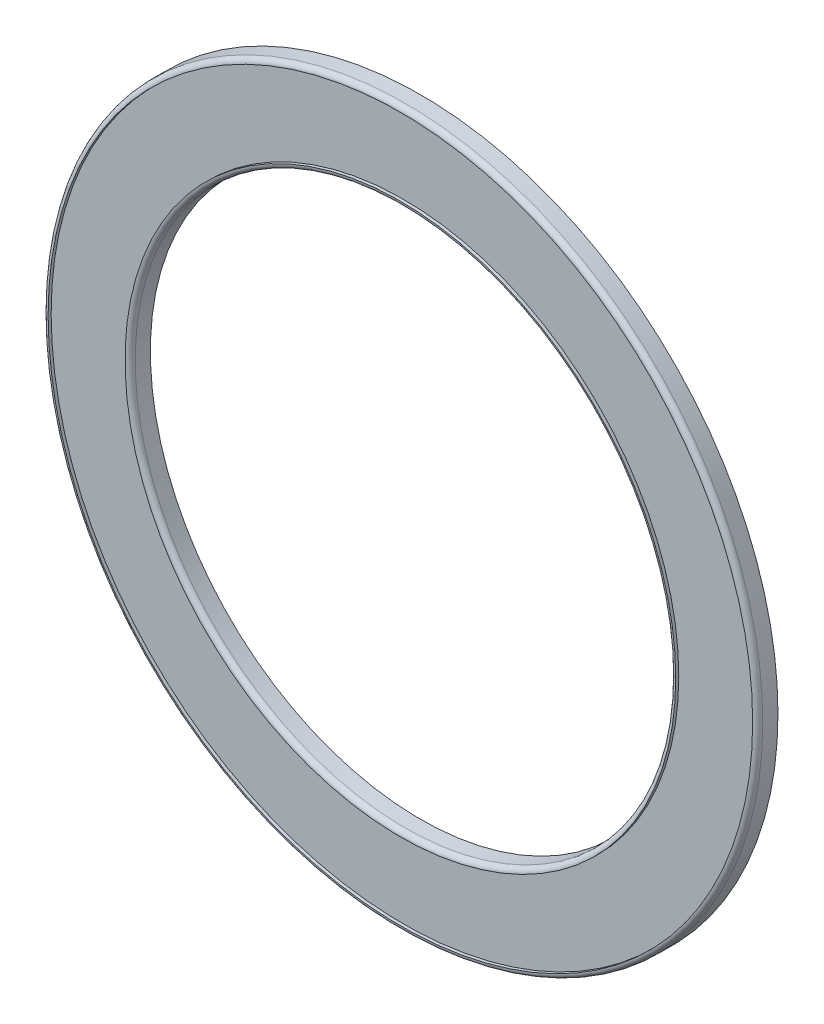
ISO-10303-21;
HEADER;
FILE_DESCRIPTION(('STEP AP214'),'2;1');
FILE_NAME('part.step','',(''),(''),'','','');
FILE_SCHEMA(('AUTOMOTIVE_DESIGN { 1 0 10303 214 1 1 1 1 }'));
ENDSEC;
DATA;
#1=APPLICATION_CONTEXT('core data for automotive mechanical design processes');
#2=APPLICATION_PROTOCOL_DEFINITION('international standard','automotive_design',2000,#1);
#3=PRODUCT_CONTEXT('',#1,'mechanical');
#4=PRODUCT('Part','Part','',(#3));
#5=PRODUCT_RELATED_PRODUCT_CATEGORY('part','',(#4));
#6=PRODUCT_DEFINITION_FORMATION('','',#4);
#7=PRODUCT_DEFINITION_CONTEXT('part definition',#1,'design');
#8=PRODUCT_DEFINITION('design','',#6,#7);
#9=PRODUCT_DEFINITION_SHAPE('','',#8);
#10=(LENGTH_UNIT() NAMED_UNIT(*) SI_UNIT(.MILLI.,.METRE.));
#11=(NAMED_UNIT(*) PLANE_ANGLE_UNIT() SI_UNIT($,.RADIAN.));
#12=(NAMED_UNIT(*) SI_UNIT($,.STERADIAN.) SOLID_ANGLE_UNIT());
#13=UNCERTAINTY_MEASURE_WITH_UNIT(LENGTH_MEASURE(1.E-05),#10,'distance_accuracy_value','');
#14=(GEOMETRIC_REPRESENTATION_CONTEXT(3) GLOBAL_UNCERTAINTY_ASSIGNED_CONTEXT((#13)) GLOBAL_UNIT_ASSIGNED_CONTEXT((#10,
#11,#12)) REPRESENTATION_CONTEXT('',''));
#15=CARTESIAN_POINT('',(0.,0.,0.));
#16=DIRECTION('',(0.,0.,1.));
#17=DIRECTION('',(1.,0.,0.));
#18=AXIS2_PLACEMENT_3D('',#15,#16,#17);
#19=CARTESIAN_POINT('',(0.,0.,0.));
#20=DIRECTION('',(0.,0.,1.));
#21=DIRECTION('',(1.,0.,0.));
#22=AXIS2_PLACEMENT_3D('',#19,#20,#21);
#23=PLANE('',#22);
#24=CARTESIAN_POINT('',(-122.85,-87.1303703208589,0.));
#25=DIRECTION('',(0.,0.,-1.));
#26=DIRECTION('',(1.,0.,0.));
#27=AXIS2_PLACEMENT_3D('',#24,#25,#26);
#28=CIRCLE('',#27,5.00000000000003);
#29=CARTESIAN_POINT('',(-117.85,-87.1303703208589,0.));
#30=VERTEX_POINT('',#29);
#31=EDGE_CURVE('E62',#30,#30,#28,.T.);
#32=ORIENTED_EDGE('',*,*,#31,.F.);
#33=EDGE_LOOP('',(#32));
#34=FACE_BOUND('',#33,.T.);
#35=CARTESIAN_POINT('',(122.85,-87.1303703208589,0.));
#36=DIRECTION('',(0.,0.,-1.));
#37=DIRECTION('',(-1.,0.,0.));
#38=AXIS2_PLACEMENT_3D('',#35,#36,#37);
#39=CIRCLE('',#38,5.00000000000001);
#40=CARTESIAN_POINT('',(117.85,-87.1303703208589,0.));
#41=VERTEX_POINT('',#40);
#42=EDGE_CURVE('E56',#41,#41,#39,.T.);
#43=ORIENTED_EDGE('',*,*,#42,.F.);
#44=EDGE_LOOP('',(#43));
#45=FACE_BOUND('',#44,.T.);
#46=CARTESIAN_POINT('',(0.,150.6115,0.));
#47=DIRECTION('',(0.,0.,-1.));
#48=DIRECTION('',(-1.,0.,0.));
#49=AXIS2_PLACEMENT_3D('',#46,#47,#48);
#50=CIRCLE('',#49,5.);
#51=CARTESIAN_POINT('',(-5.,150.6115,0.));
#52=VERTEX_POINT('',#51);
#53=EDGE_CURVE('E50',#52,#52,#50,.T.);
#54=ORIENTED_EDGE('',*,*,#53,.F.);
#55=EDGE_LOOP('',(#54));
#56=FACE_BOUND('',#55,.T.);
#57=CARTESIAN_POINT('',(0.,0.,0.));
#58=DIRECTION('',(0.,0.,1.));
#59=DIRECTION('',(1.,0.,0.));
#60=AXIS2_PLACEMENT_3D('',#57,#58,#59);
#61=CIRCLE('',#60,176.5);
#62=CARTESIAN_POINT('',(176.5,0.,0.));
#63=VERTEX_POINT('',#62);
#64=EDGE_CURVE('E40',#63,#63,#61,.T.);
#65=ORIENTED_EDGE('',*,*,#64,.F.);
#66=EDGE_LOOP('',(#65));
#67=FACE_BOUND('',#66,.T.);
#68=CARTESIAN_POINT('',(0.,0.,0.));
#69=DIRECTION('',(0.,0.,1.));
#70=DIRECTION('',(1.,0.,0.));
#71=AXIS2_PLACEMENT_3D('',#68,#69,#70);
#72=CIRCLE('',#71,133.5);
#73=CARTESIAN_POINT('',(133.5,0.,0.));
#74=VERTEX_POINT('',#73);
#75=EDGE_CURVE('E44',#74,#74,#72,.T.);
#76=ORIENTED_EDGE('',*,*,#75,.T.);
#77=EDGE_LOOP('',(#76));
#78=FACE_BOUND('',#77,.T.);
#79=ADVANCED_FACE('F29',(#34,#45,#56,#67,#78),#23,.F.);
#80=CARTESIAN_POINT('',(0.,0.,10.));
#81=DIRECTION('',(0.,0.,-1.));
#82=DIRECTION('',(-1.,0.,0.));
#83=AXIS2_PLACEMENT_3D('',#80,#81,#82);
#84=CYLINDRICAL_SURFACE('',#83,176.5);
#85=CARTESIAN_POINT('',(0.,0.,7.5));
#86=DIRECTION('',(0.,0.,1.));
#87=DIRECTION('',(1.,0.,0.));
#88=AXIS2_PLACEMENT_3D('',#85,#86,#87);
#89=CIRCLE('',#88,176.5);
#90=CARTESIAN_POINT('',(176.5,0.,7.5));
#91=VERTEX_POINT('',#90);
#92=EDGE_CURVE('E10',#91,#91,#89,.F.);
#93=ORIENTED_EDGE('',*,*,#92,.T.);
#94=EDGE_LOOP('',(#93));
#95=FACE_BOUND('',#94,.T.);
#96=ORIENTED_EDGE('',*,*,#64,.T.);
#97=EDGE_LOOP('',(#96));
#98=FACE_BOUND('',#97,.T.);
#99=ADVANCED_FACE('F104',(#95,#98),#84,.T.);
#100=CARTESIAN_POINT('',(0.,0.,10.));
#101=DIRECTION('',(0.,0.,-1.));
#102=DIRECTION('',(-1.,0.,0.));
#103=AXIS2_PLACEMENT_3D('',#100,#101,#102);
#104=CYLINDRICAL_SURFACE('',#103,133.5);
#105=CARTESIAN_POINT('',(0.,0.,7.5));
#106=DIRECTION('',(0.,0.,1.));
#107=DIRECTION('',(1.,0.,0.));
#108=AXIS2_PLACEMENT_3D('',#105,#106,#107);
#109=CIRCLE('',#108,133.5);
#110=CARTESIAN_POINT('',(133.5,0.,7.5));
#111=VERTEX_POINT('',#110);
#112=EDGE_CURVE('E36',#111,#111,#109,.T.);
#113=ORIENTED_EDGE('',*,*,#112,.T.);
#114=EDGE_LOOP('',(#113));
#115=FACE_BOUND('',#114,.T.);
#116=ORIENTED_EDGE('',*,*,#75,.F.);
#117=EDGE_LOOP('',(#116));
#118=FACE_BOUND('',#117,.T.);
#119=ADVANCED_FACE('F110',(#115,#118),#104,.F.);
#120=CARTESIAN_POINT('',(0.,150.6115,5.));
#121=DIRECTION('',(0.,0.,-1.));
#122=DIRECTION('',(-1.,0.,0.));
#123=AXIS2_PLACEMENT_3D('',#120,#121,#122);
#124=CYLINDRICAL_SURFACE('',#123,5.);
#125=CARTESIAN_POINT('',(0.,150.6115,5.));
#126=DIRECTION('',(0.,0.,-1.));
#127=DIRECTION('',(-1.,0.,0.));
#128=AXIS2_PLACEMENT_3D('',#125,#126,#127);
#129=CIRCLE('',#128,5.);
#130=CARTESIAN_POINT('',(-5.,150.6115,5.));
#131=VERTEX_POINT('',#130);
#132=EDGE_CURVE('E49',#131,#131,#129,.T.);
#133=ORIENTED_EDGE('',*,*,#132,.F.);
#134=EDGE_LOOP('',(#133));
#135=FACE_BOUND('',#134,.T.);
#136=ORIENTED_EDGE('',*,*,#53,.T.);
#137=EDGE_LOOP('',(#136));
#138=FACE_BOUND('',#137,.T.);
#139=ADVANCED_FACE('F117',(#135,#138),#124,.F.);
#140=CARTESIAN_POINT('',(0.,150.6115,5.));
#141=DIRECTION('',(0.,0.,-1.));
#142=DIRECTION('',(-1.,0.,0.));
#143=AXIS2_PLACEMENT_3D('',#140,#141,#142);
#144=PLANE('',#143);
#145=ORIENTED_EDGE('',*,*,#132,.T.);
#146=EDGE_LOOP('',(#145));
#147=FACE_BOUND('',#146,.T.);
#148=ADVANCED_FACE('F120',(#147),#144,.T.);
#149=CARTESIAN_POINT('',(122.85,-87.1303703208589,5.));
#150=DIRECTION('',(0.,0.,-1.));
#151=DIRECTION('',(-1.,0.,0.));
#152=AXIS2_PLACEMENT_3D('',#149,#150,#151);
#153=CYLINDRICAL_SURFACE('',#152,5.00000000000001);
#154=CARTESIAN_POINT('',(122.85,-87.1303703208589,5.));
#155=DIRECTION('',(0.,0.,-1.));
#156=DIRECTION('',(-1.,0.,0.));
#157=AXIS2_PLACEMENT_3D('',#154,#155,#156);
#158=CIRCLE('',#157,5.00000000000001);
#159=CARTESIAN_POINT('',(117.85,-87.1303703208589,5.));
#160=VERTEX_POINT('',#159);
#161=EDGE_CURVE('E53',#160,#160,#158,.T.);
#162=ORIENTED_EDGE('',*,*,#161,.F.);
#163=EDGE_LOOP('',(#162));
#164=FACE_BOUND('',#163,.T.);
#165=ORIENTED_EDGE('',*,*,#42,.T.);
#166=EDGE_LOOP('',(#165));
#167=FACE_BOUND('',#166,.T.);
#168=ADVANCED_FACE('F124',(#164,#167),#153,.F.);
#169=CARTESIAN_POINT('',(122.85,-87.1303703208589,5.));
#170=DIRECTION('',(0.,0.,-1.));
#171=DIRECTION('',(-1.,0.,0.));
#172=AXIS2_PLACEMENT_3D('',#169,#170,#171);
#173=PLANE('',#172);
#174=ORIENTED_EDGE('',*,*,#161,.T.);
#175=EDGE_LOOP('',(#174));
#176=FACE_BOUND('',#175,.T.);
#177=ADVANCED_FACE('F128',(#176),#173,.T.);
#178=CARTESIAN_POINT('',(-122.85,-87.1303703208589,5.));
#179=DIRECTION('',(0.,0.,-1.));
#180=DIRECTION('',(-1.,0.,0.));
#181=AXIS2_PLACEMENT_3D('',#178,#179,#180);
#182=CYLINDRICAL_SURFACE('',#181,5.00000000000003);
#183=CARTESIAN_POINT('',(-122.85,-87.1303703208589,5.));
#184=DIRECTION('',(0.,0.,-1.));
#185=DIRECTION('',(1.,0.,0.));
#186=AXIS2_PLACEMENT_3D('',#183,#184,#185);
#187=CIRCLE('',#186,5.00000000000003);
#188=CARTESIAN_POINT('',(-117.85,-87.1303703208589,5.));
#189=VERTEX_POINT('',#188);
#190=EDGE_CURVE('E59',#189,#189,#187,.T.);
#191=ORIENTED_EDGE('',*,*,#190,.F.);
#192=EDGE_LOOP('',(#191));
#193=FACE_BOUND('',#192,.T.);
#194=ORIENTED_EDGE('',*,*,#31,.T.);
#195=EDGE_LOOP('',(#194));
#196=FACE_BOUND('',#195,.T.);
#197=ADVANCED_FACE('F132',(#193,#196),#182,.F.);
#198=CARTESIAN_POINT('',(-122.85,-87.1303703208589,5.));
#199=DIRECTION('',(0.,0.,1.));
#200=DIRECTION('',(1.,0.,0.));
#201=AXIS2_PLACEMENT_3D('',#198,#199,#200);
#202=PLANE('',#201);
#203=ORIENTED_EDGE('',*,*,#190,.T.);
#204=EDGE_LOOP('',(#203));
#205=FACE_BOUND('',#204,.T.);
#206=ADVANCED_FACE('F92',(#205),#202,.F.);
#207=CARTESIAN_POINT('',(0.,0.,8.5));
#208=DIRECTION('',(0.,0.,1.));
#209=DIRECTION('',(1.,0.,0.));
#210=AXIS2_PLACEMENT_3D('',#207,#208,#209);
#211=CYLINDRICAL_SURFACE('',#210,174.);
#212=CARTESIAN_POINT('',(0.,0.,8.5));
#213=DIRECTION('',(0.,0.,1.));
#214=DIRECTION('',(1.,0.,0.));
#215=AXIS2_PLACEMENT_3D('',#212,#213,#214);
#216=CIRCLE('',#215,174.);
#217=CARTESIAN_POINT('',(174.,0.,8.5));
#218=VERTEX_POINT('',#217);
#219=EDGE_CURVE('E65',#218,#218,#216,.T.);
#220=ORIENTED_EDGE('',*,*,#219,.F.);
#221=EDGE_LOOP('',(#220));
#222=FACE_BOUND('',#221,.T.);
#223=CARTESIAN_POINT('',(0.,0.,10.));
#224=DIRECTION('',(0.,0.,1.));
#225=DIRECTION('',(1.,0.,0.));
#226=AXIS2_PLACEMENT_3D('',#223,#224,#225);
#227=CIRCLE('',#226,174.);
#228=CARTESIAN_POINT('',(174.,0.,10.));
#229=VERTEX_POINT('',#228);
#230=EDGE_CURVE('E68',#229,#229,#227,.T.);
#231=ORIENTED_EDGE('',*,*,#230,.T.);
#232=EDGE_LOOP('',(#231));
#233=FACE_BOUND('',#232,.T.);
#234=ADVANCED_FACE('F86',(#222,#233),#211,.F.);
#235=CARTESIAN_POINT('',(0.,0.,8.5));
#236=DIRECTION('',(0.,0.,1.));
#237=DIRECTION('',(1.,0.,0.));
#238=AXIS2_PLACEMENT_3D('',#235,#236,#237);
#239=PLANE('',#238);
#240=CARTESIAN_POINT('',(0.,0.,8.5));
#241=DIRECTION('',(0.,0.,1.));
#242=DIRECTION('',(1.,0.,0.));
#243=AXIS2_PLACEMENT_3D('',#240,#241,#242);
#244=CIRCLE('',#243,136.);
#245=CARTESIAN_POINT('',(136.,0.,8.5));
#246=VERTEX_POINT('',#245);
#247=EDGE_CURVE('E71',#246,#246,#244,.T.);
#248=ORIENTED_EDGE('',*,*,#247,.F.);
#249=EDGE_LOOP('',(#248));
#250=FACE_BOUND('',#249,.T.);
#251=ORIENTED_EDGE('',*,*,#219,.T.);
#252=EDGE_LOOP('',(#251));
#253=FACE_BOUND('',#252,.T.);
#254=ADVANCED_FACE('F83',(#250,#253),#239,.T.);
#255=CARTESIAN_POINT('',(0.,0.,8.5));
#256=DIRECTION('',(0.,0.,1.));
#257=DIRECTION('',(1.,0.,0.));
#258=AXIS2_PLACEMENT_3D('',#255,#256,#257);
#259=CYLINDRICAL_SURFACE('',#258,136.);
#260=ORIENTED_EDGE('',*,*,#247,.T.);
#261=EDGE_LOOP('',(#260));
#262=FACE_BOUND('',#261,.T.);
#263=CARTESIAN_POINT('',(0.,0.,10.));
#264=DIRECTION('',(0.,0.,1.));
#265=DIRECTION('',(1.,0.,0.));
#266=AXIS2_PLACEMENT_3D('',#263,#264,#265);
#267=CIRCLE('',#266,136.);
#268=CARTESIAN_POINT('',(136.,0.,10.));
#269=VERTEX_POINT('',#268);
#270=EDGE_CURVE('E74',#269,#269,#267,.T.);
#271=ORIENTED_EDGE('',*,*,#270,.F.);
#272=EDGE_LOOP('',(#271));
#273=FACE_BOUND('',#272,.T.);
#274=ADVANCED_FACE('F80',(#262,#273),#259,.T.);
#275=CARTESIAN_POINT('',(0.,0.,7.5));
#276=DIRECTION('',(0.,0.,1.));
#277=DIRECTION('',(1.,0.,0.));
#278=AXIS2_PLACEMENT_3D('',#275,#276,#277);
#279=TOROIDAL_SURFACE('',#278,136.,2.5);
#280=ORIENTED_EDGE('',*,*,#270,.T.);
#281=EDGE_LOOP('',(#280));
#282=FACE_BOUND('',#281,.T.);
#283=ORIENTED_EDGE('',*,*,#112,.F.);
#284=EDGE_LOOP('',(#283));
#285=FACE_BOUND('',#284,.T.);
#286=ADVANCED_FACE('F97',(#282,#285),#279,.T.);
#287=CARTESIAN_POINT('',(0.,0.,7.5));
#288=DIRECTION('',(0.,0.,1.));
#289=DIRECTION('',(1.,0.,0.));
#290=AXIS2_PLACEMENT_3D('',#287,#288,#289);
#291=TOROIDAL_SURFACE('',#290,174.,2.5);
#292=ORIENTED_EDGE('',*,*,#92,.F.);
#293=EDGE_LOOP('',(#292));
#294=FACE_BOUND('',#293,.T.);
#295=ORIENTED_EDGE('',*,*,#230,.F.);
#296=EDGE_LOOP('',(#295));
#297=FACE_BOUND('',#296,.T.);
#298=ADVANCED_FACE('F31',(#294,#297),#291,.T.);
#299=CLOSED_SHELL('',(#79,#99,#119,#139,#148,#168,#177,#197,#206,#234,#254,#274,#286,#298));
#300=MANIFOLD_SOLID_BREP('B2',#299);
#301=ADVANCED_BREP_SHAPE_REPRESENTATION('',(#18,#300),#14);
#302=SHAPE_DEFINITION_REPRESENTATION(#9,#301);
ENDSEC;
END-ISO-10303-21;
